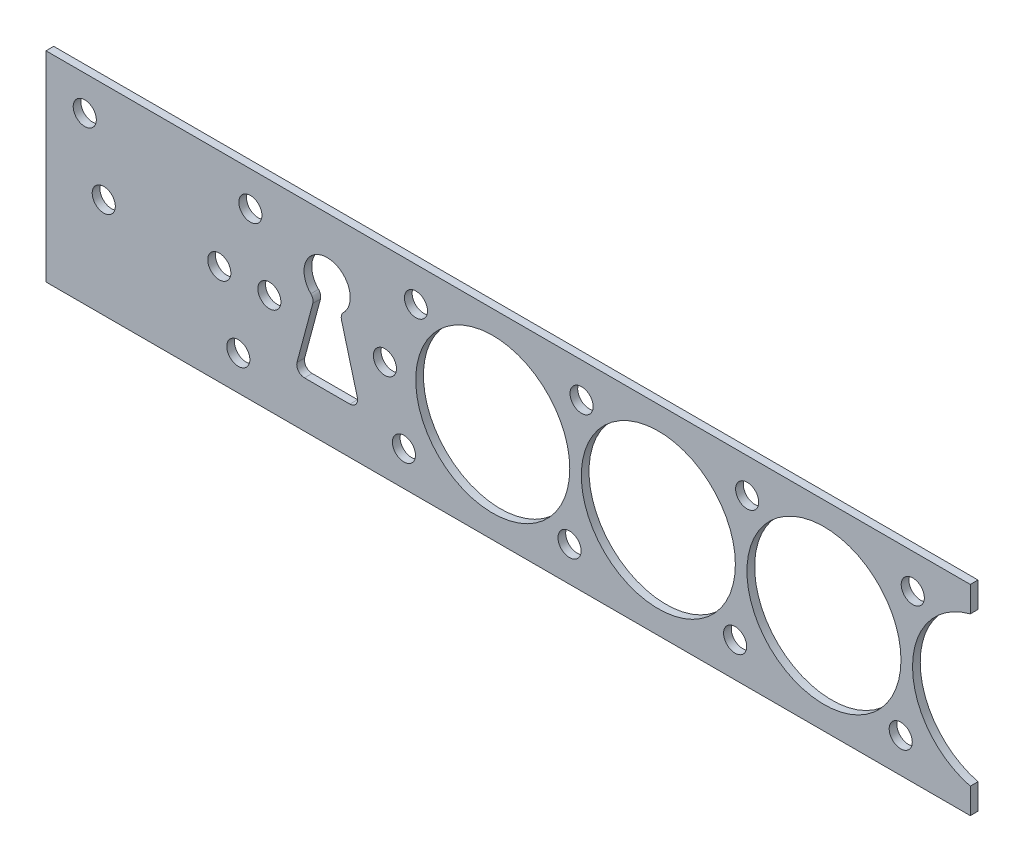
from build123d import *

# Parameters (mm, degrees)
ESQUISSE1_R        = 1.5
ESQUISSE1_R_2      = 10
BOSS_EXTRU_1_DEPTH = 1


with BuildPart() as part:
    # Esquisse1 → Boss.-Extru.1 (new body)
    with BuildSketch(Plane.XY):
        with BuildLine():
            Line((-15, -13), (105, -13))
            Line((105, -13), (105, -9.682458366))
            ThreePointArc((105, -9.682458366), (97.5, 0), (105, 9.682458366))
            Line((105, 9.682458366), (105, 13))
            Line((105, 13), (-15, 13))
            Line((-15, 13), (-15, -13))
        make_face()
        with Locations((-9.967948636, 8.5)):
            Circle(ESQUISSE1_R, mode=Mode.SUBTRACT)
        with Locations((9.967948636, -8.5)):
            Circle(ESQUISSE1_R, mode=Mode.SUBTRACT)
        with Locations((43, 0)):
            Circle(ESQUISSE1_R_2, mode=Mode.SUBTRACT)
        with Locations((-7.5, 0)):
            Circle(ESQUISSE1_R, mode=Mode.SUBTRACT)
        with Locations((7.5, 0)):
            Circle(ESQUISSE1_R, mode=Mode.SUBTRACT)
        with Locations((11.532051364, 8.5)):
            Circle(ESQUISSE1_R, mode=Mode.SUBTRACT)
        with Locations((31.467948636, -8.5)):
            Circle(ESQUISSE1_R, mode=Mode.SUBTRACT)
        with Locations((33.032051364, 8.5)):
            Circle(ESQUISSE1_R, mode=Mode.SUBTRACT)
        with Locations((52.967948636, -8.5)):
            Circle(ESQUISSE1_R, mode=Mode.SUBTRACT)
        with Locations((54.532051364, 8.5)):
            Circle(ESQUISSE1_R, mode=Mode.SUBTRACT)
        with Locations((74.467948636, -8.5)):
            Circle(ESQUISSE1_R, mode=Mode.SUBTRACT)
        with Locations((76.032051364, 8.5)):
            Circle(ESQUISSE1_R, mode=Mode.SUBTRACT)
        with Locations((95.967948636, -8.5)):
            Circle(ESQUISSE1_R, mode=Mode.SUBTRACT)
        with Locations((97.532051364, 8.5)):
            Circle(ESQUISSE1_R, mode=Mode.SUBTRACT)
        with Locations((14, 0)):
            Circle(ESQUISSE1_R, mode=Mode.SUBTRACT)
        with Locations((29, 0)):
            Circle(ESQUISSE1_R, mode=Mode.SUBTRACT)
        with Locations((64.5, 0)):
            Circle(ESQUISSE1_R_2, mode=Mode.SUBTRACT)
        with Locations((86, 0)):
            Circle(ESQUISSE1_R_2, mode=Mode.SUBTRACT)
        with BuildLine():
            Line((19.637498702, 1.91275383), (17.586633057, -5.741180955))
            ThreePointArc((17.586633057, -5.741180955), (17.759205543, -6.608761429), (18.552558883, -7))
            Line((18.552558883, -7), (24.447441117, -7))
            ThreePointArc((24.447441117, -7), (25.240794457, -6.608761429), (25.413366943, -5.741180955))
            Line((25.413366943, -5.741180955), (23.362501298, 1.91275383))
            ThreePointArc((23.362501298, 1.91275383), (23.362501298, 2.43039192), (23.621320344, 2.878679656))
            ThreePointArc((23.621320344, 2.878679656), (21.5, 8), (19.378679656, 2.878679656))
            ThreePointArc((19.378679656, 2.878679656), (19.637498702, 2.43039192), (19.637498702, 1.91275383))
        make_face(mode=Mode.SUBTRACT)
    extrude(amount=BOSS_EXTRU_1_DEPTH)


solid = part.part
